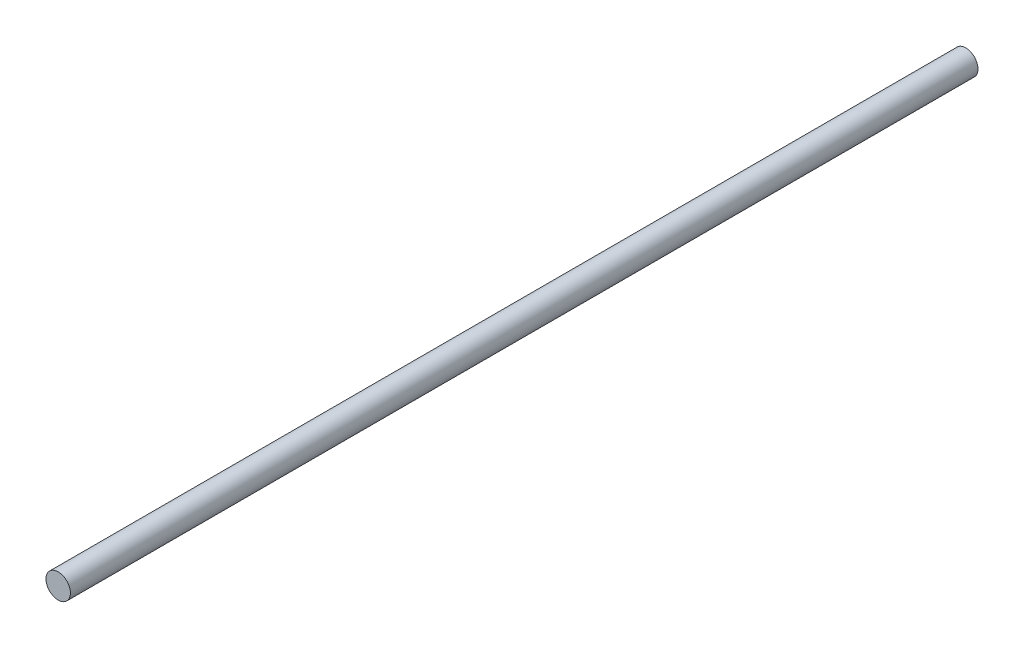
ISO-10303-21;
HEADER;
FILE_DESCRIPTION(('STEP AP214'),'2;1');
FILE_NAME('part.step','',(''),(''),'','','');
FILE_SCHEMA(('AUTOMOTIVE_DESIGN { 1 0 10303 214 1 1 1 1 }'));
ENDSEC;
DATA;
#1=APPLICATION_CONTEXT('core data for automotive mechanical design processes');
#2=APPLICATION_PROTOCOL_DEFINITION('international standard','automotive_design',2000,#1);
#3=PRODUCT_CONTEXT('',#1,'mechanical');
#4=PRODUCT('Part','Part','',(#3));
#5=PRODUCT_RELATED_PRODUCT_CATEGORY('part','',(#4));
#6=PRODUCT_DEFINITION_FORMATION('','',#4);
#7=PRODUCT_DEFINITION_CONTEXT('part definition',#1,'design');
#8=PRODUCT_DEFINITION('design','',#6,#7);
#9=PRODUCT_DEFINITION_SHAPE('','',#8);
#10=(LENGTH_UNIT() NAMED_UNIT(*) SI_UNIT(.MILLI.,.METRE.));
#11=(NAMED_UNIT(*) PLANE_ANGLE_UNIT() SI_UNIT($,.RADIAN.));
#12=(NAMED_UNIT(*) SI_UNIT($,.STERADIAN.) SOLID_ANGLE_UNIT());
#13=UNCERTAINTY_MEASURE_WITH_UNIT(LENGTH_MEASURE(1.E-05),#10,'distance_accuracy_value','');
#14=(GEOMETRIC_REPRESENTATION_CONTEXT(3) GLOBAL_UNCERTAINTY_ASSIGNED_CONTEXT((#13)) GLOBAL_UNIT_ASSIGNED_CONTEXT((#10,
#11,#12)) REPRESENTATION_CONTEXT('',''));
#15=CARTESIAN_POINT('',(0.,0.,0.));
#16=DIRECTION('',(0.,0.,1.));
#17=DIRECTION('',(1.,0.,0.));
#18=AXIS2_PLACEMENT_3D('',#15,#16,#17);
#19=CARTESIAN_POINT('',(0.,0.,148.5));
#20=DIRECTION('',(0.,0.,-1.));
#21=DIRECTION('',(-1.,0.,0.));
#22=AXIS2_PLACEMENT_3D('',#19,#20,#21);
#23=CYLINDRICAL_SURFACE('',#22,4.);
#24=CARTESIAN_POINT('',(0.,0.,148.5));
#25=DIRECTION('',(0.,0.,1.));
#26=DIRECTION('',(1.,0.,0.));
#27=AXIS2_PLACEMENT_3D('',#24,#25,#26);
#28=CIRCLE('',#27,4.);
#29=CARTESIAN_POINT('',(4.,0.,148.5));
#30=VERTEX_POINT('',#29);
#31=EDGE_CURVE('E10',#30,#30,#28,.T.);
#32=ORIENTED_EDGE('',*,*,#31,.F.);
#33=EDGE_LOOP('',(#32));
#34=FACE_BOUND('',#33,.T.);
#35=CARTESIAN_POINT('',(0.,0.,-148.5));
#36=DIRECTION('',(0.,0.,1.));
#37=DIRECTION('',(1.,0.,0.));
#38=AXIS2_PLACEMENT_3D('',#35,#36,#37);
#39=CIRCLE('',#38,4.);
#40=CARTESIAN_POINT('',(4.,0.,-148.5));
#41=VERTEX_POINT('',#40);
#42=EDGE_CURVE('E34',#41,#41,#39,.T.);
#43=ORIENTED_EDGE('',*,*,#42,.T.);
#44=EDGE_LOOP('',(#43));
#45=FACE_BOUND('',#44,.T.);
#46=ADVANCED_FACE('F31',(#34,#45),#23,.T.);
#47=CARTESIAN_POINT('',(0.,0.,148.5));
#48=DIRECTION('',(0.,0.,1.));
#49=DIRECTION('',(1.,0.,0.));
#50=AXIS2_PLACEMENT_3D('',#47,#48,#49);
#51=PLANE('',#50);
#52=ORIENTED_EDGE('',*,*,#31,.T.);
#53=EDGE_LOOP('',(#52));
#54=FACE_BOUND('',#53,.T.);
#55=ADVANCED_FACE('F46',(#54),#51,.T.);
#56=CARTESIAN_POINT('',(0.,0.,-148.5));
#57=DIRECTION('',(0.,0.,1.));
#58=DIRECTION('',(1.,0.,0.));
#59=AXIS2_PLACEMENT_3D('',#56,#57,#58);
#60=PLANE('',#59);
#61=ORIENTED_EDGE('',*,*,#42,.F.);
#62=EDGE_LOOP('',(#61));
#63=FACE_BOUND('',#62,.T.);
#64=ADVANCED_FACE('F44',(#63),#60,.F.);
#65=CLOSED_SHELL('',(#46,#55,#64));
#66=MANIFOLD_SOLID_BREP('B2',#65);
#67=ADVANCED_BREP_SHAPE_REPRESENTATION('',(#18,#66),#14);
#68=SHAPE_DEFINITION_REPRESENTATION(#9,#67);
ENDSEC;
END-ISO-10303-21;
